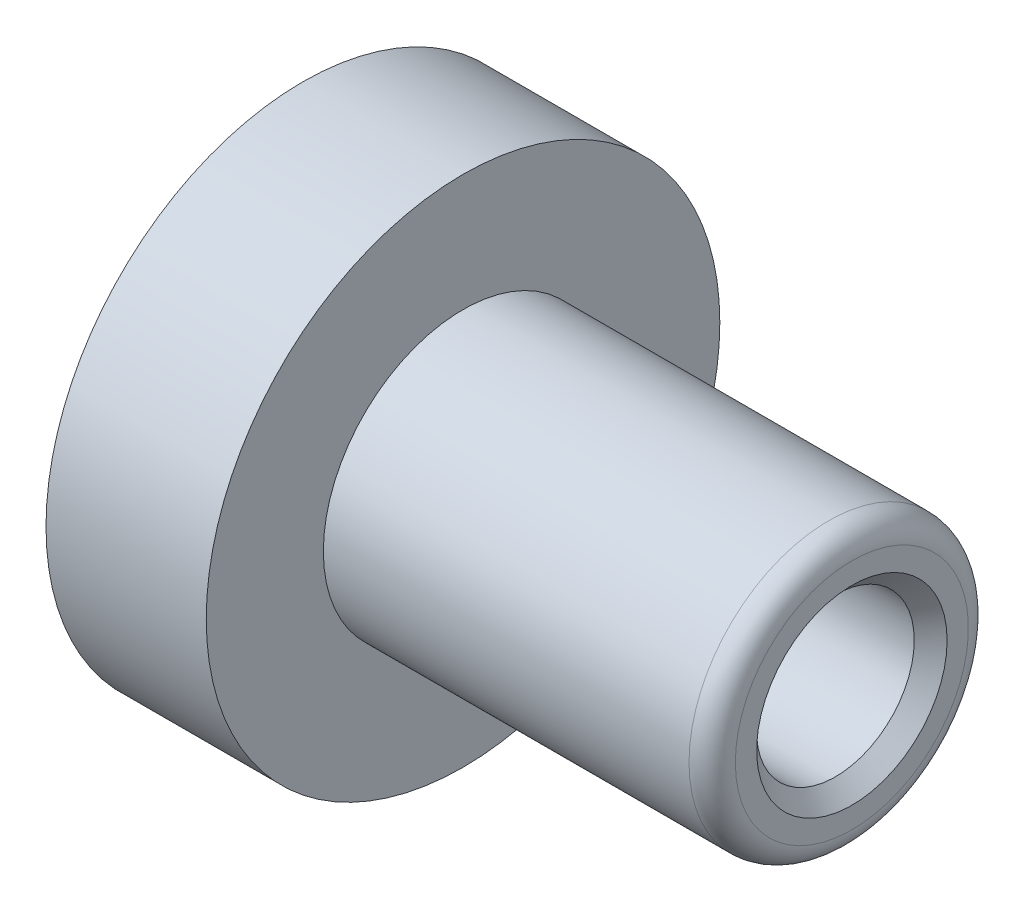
ISO-10303-21;
HEADER;
FILE_DESCRIPTION(('STEP AP214'),'2;1');
FILE_NAME('part.step','',(''),(''),'','','');
FILE_SCHEMA(('AUTOMOTIVE_DESIGN { 1 0 10303 214 1 1 1 1 }'));
ENDSEC;
DATA;
#1=APPLICATION_CONTEXT('core data for automotive mechanical design processes');
#2=APPLICATION_PROTOCOL_DEFINITION('international standard','automotive_design',2000,#1);
#3=PRODUCT_CONTEXT('',#1,'mechanical');
#4=PRODUCT('Part','Part','',(#3));
#5=PRODUCT_RELATED_PRODUCT_CATEGORY('part','',(#4));
#6=PRODUCT_DEFINITION_FORMATION('','',#4);
#7=PRODUCT_DEFINITION_CONTEXT('part definition',#1,'design');
#8=PRODUCT_DEFINITION('design','',#6,#7);
#9=PRODUCT_DEFINITION_SHAPE('','',#8);
#10=(LENGTH_UNIT() NAMED_UNIT(*) SI_UNIT(.MILLI.,.METRE.));
#11=(NAMED_UNIT(*) PLANE_ANGLE_UNIT() SI_UNIT($,.RADIAN.));
#12=(NAMED_UNIT(*) SI_UNIT($,.STERADIAN.) SOLID_ANGLE_UNIT());
#13=UNCERTAINTY_MEASURE_WITH_UNIT(LENGTH_MEASURE(1.E-05),#10,'distance_accuracy_value','');
#14=(GEOMETRIC_REPRESENTATION_CONTEXT(3) GLOBAL_UNCERTAINTY_ASSIGNED_CONTEXT((#13)) GLOBAL_UNIT_ASSIGNED_CONTEXT((#10,
#11,#12)) REPRESENTATION_CONTEXT('',''));
#15=CARTESIAN_POINT('',(0.,0.,0.));
#16=DIRECTION('',(0.,0.,1.));
#17=DIRECTION('',(1.,0.,0.));
#18=AXIS2_PLACEMENT_3D('',#15,#16,#17);
#19=CARTESIAN_POINT('',(0.,0.,0.));
#20=DIRECTION('',(-1.,0.,0.));
#21=DIRECTION('',(0.,0.,1.));
#22=AXIS2_PLACEMENT_3D('',#19,#20,#21);
#23=CYLINDRICAL_SURFACE('',#22,6.7437);
#24=CARTESIAN_POINT('',(20.447,0.,0.));
#25=DIRECTION('',(-1.,0.,0.));
#26=DIRECTION('',(0.,0.,1.));
#27=AXIS2_PLACEMENT_3D('',#24,#25,#26);
#28=CIRCLE('',#27,6.7437);
#29=CARTESIAN_POINT('',(20.447,0.,6.7437));
#30=VERTEX_POINT('',#29);
#31=EDGE_CURVE('E42',#30,#30,#28,.T.);
#32=ORIENTED_EDGE('',*,*,#31,.F.);
#33=EDGE_LOOP('',(#32));
#34=FACE_BOUND('',#33,.T.);
#35=CARTESIAN_POINT('',(0.,0.,0.));
#36=DIRECTION('',(-1.,0.,0.));
#37=DIRECTION('',(0.,0.,1.));
#38=AXIS2_PLACEMENT_3D('',#35,#36,#37);
#39=CIRCLE('',#38,6.7437);
#40=CARTESIAN_POINT('',(0.,0.,6.7437));
#41=VERTEX_POINT('',#40);
#42=EDGE_CURVE('E63',#41,#41,#39,.T.);
#43=ORIENTED_EDGE('',*,*,#42,.T.);
#44=EDGE_LOOP('',(#43));
#45=FACE_BOUND('',#44,.T.);
#46=ADVANCED_FACE('F31',(#34,#45),#23,.F.);
#47=CARTESIAN_POINT('',(20.447,6.7437,0.));
#48=DIRECTION('',(1.,0.,0.));
#49=DIRECTION('',(0.,0.,-1.));
#50=AXIS2_PLACEMENT_3D('',#47,#48,#49);
#51=PLANE('',#50);
#52=CARTESIAN_POINT('',(20.447,0.,0.));
#53=DIRECTION('',(1.,0.,0.));
#54=DIRECTION('',(0.,0.,-1.));
#55=AXIS2_PLACEMENT_3D('',#52,#53,#54);
#56=CIRCLE('',#55,5.3594);
#57=CARTESIAN_POINT('',(20.447,0.,-5.3594));
#58=VERTEX_POINT('',#57);
#59=EDGE_CURVE('E76',#58,#58,#56,.T.);
#60=ORIENTED_EDGE('',*,*,#59,.T.);
#61=EDGE_LOOP('',(#60));
#62=FACE_BOUND('',#61,.T.);
#63=ORIENTED_EDGE('',*,*,#31,.T.);
#64=EDGE_LOOP('',(#63));
#65=FACE_BOUND('',#64,.T.);
#66=ADVANCED_FACE('F82',(#62,#65),#51,.F.);
#67=CARTESIAN_POINT('',(37.338,7.9248,0.));
#68=DIRECTION('',(-1.,0.,0.));
#69=DIRECTION('',(0.,0.,1.));
#70=AXIS2_PLACEMENT_3D('',#67,#68,#69);
#71=PLANE('',#70);
#72=CARTESIAN_POINT('',(37.338,0.,0.));
#73=DIRECTION('',(-1.,0.,0.));
#74=DIRECTION('',(0.,0.,1.));
#75=AXIS2_PLACEMENT_3D('',#72,#73,#74);
#76=CIRCLE('',#75,6.477);
#77=CARTESIAN_POINT('',(37.338,0.,-6.477));
#78=VERTEX_POINT('',#77);
#79=EDGE_CURVE('E10',#78,#78,#76,.T.);
#80=ORIENTED_EDGE('',*,*,#79,.T.);
#81=EDGE_LOOP('',(#80));
#82=FACE_BOUND('',#81,.T.);
#83=CARTESIAN_POINT('',(37.338,0.,0.));
#84=DIRECTION('',(-1.,0.,0.));
#85=DIRECTION('',(0.,0.,1.));
#86=AXIS2_PLACEMENT_3D('',#83,#84,#85);
#87=CIRCLE('',#86,7.9248);
#88=CARTESIAN_POINT('',(37.338,0.,7.9248));
#89=VERTEX_POINT('',#88);
#90=EDGE_CURVE('E46',#89,#89,#87,.T.);
#91=ORIENTED_EDGE('',*,*,#90,.F.);
#92=EDGE_LOOP('',(#91));
#93=FACE_BOUND('',#92,.T.);
#94=ADVANCED_FACE('F102',(#82,#93),#71,.F.);
#95=CARTESIAN_POINT('',(35.7632,0.,0.));
#96=DIRECTION('',(-1.,0.,0.));
#97=DIRECTION('',(0.,0.,1.));
#98=AXIS2_PLACEMENT_3D('',#95,#96,#97);
#99=TOROIDAL_SURFACE('',#98,7.9248,1.5748);
#100=CARTESIAN_POINT('',(35.7632,0.,0.));
#101=DIRECTION('',(-1.,0.,0.));
#102=DIRECTION('',(0.,0.,1.));
#103=AXIS2_PLACEMENT_3D('',#100,#101,#102);
#104=CIRCLE('',#103,9.4996);
#105=CARTESIAN_POINT('',(35.7632,0.,9.4996));
#106=VERTEX_POINT('',#105);
#107=EDGE_CURVE('E51',#106,#106,#104,.T.);
#108=ORIENTED_EDGE('',*,*,#107,.F.);
#109=EDGE_LOOP('',(#108));
#110=FACE_BOUND('',#109,.T.);
#111=ORIENTED_EDGE('',*,*,#90,.T.);
#112=EDGE_LOOP('',(#111));
#113=FACE_BOUND('',#112,.T.);
#114=ADVANCED_FACE('F109',(#110,#113),#99,.T.);
#115=CARTESIAN_POINT('',(0.,0.,0.));
#116=DIRECTION('',(-1.,0.,0.));
#117=DIRECTION('',(0.,0.,1.));
#118=AXIS2_PLACEMENT_3D('',#115,#116,#117);
#119=CYLINDRICAL_SURFACE('',#118,9.4996);
#120=CARTESIAN_POINT('',(10.8966,0.,0.));
#121=DIRECTION('',(-1.,0.,0.));
#122=DIRECTION('',(0.,0.,1.));
#123=AXIS2_PLACEMENT_3D('',#120,#121,#122);
#124=CIRCLE('',#123,9.4996);
#125=CARTESIAN_POINT('',(10.8966,0.,9.4996));
#126=VERTEX_POINT('',#125);
#127=EDGE_CURVE('E54',#126,#126,#124,.T.);
#128=ORIENTED_EDGE('',*,*,#127,.F.);
#129=EDGE_LOOP('',(#128));
#130=FACE_BOUND('',#129,.T.);
#131=ORIENTED_EDGE('',*,*,#107,.T.);
#132=EDGE_LOOP('',(#131));
#133=FACE_BOUND('',#132,.T.);
#134=ADVANCED_FACE('F112',(#130,#133),#119,.T.);
#135=CARTESIAN_POINT('',(10.8966,17.4625,0.));
#136=DIRECTION('',(-1.,0.,0.));
#137=DIRECTION('',(0.,0.,1.));
#138=AXIS2_PLACEMENT_3D('',#135,#136,#137);
#139=PLANE('',#138);
#140=CARTESIAN_POINT('',(10.8966,0.,0.));
#141=DIRECTION('',(-1.,0.,0.));
#142=DIRECTION('',(0.,0.,1.));
#143=AXIS2_PLACEMENT_3D('',#140,#141,#142);
#144=CIRCLE('',#143,17.4625);
#145=CARTESIAN_POINT('',(10.8966,0.,17.4625));
#146=VERTEX_POINT('',#145);
#147=EDGE_CURVE('E57',#146,#146,#144,.T.);
#148=ORIENTED_EDGE('',*,*,#147,.F.);
#149=EDGE_LOOP('',(#148));
#150=FACE_BOUND('',#149,.T.);
#151=ORIENTED_EDGE('',*,*,#127,.T.);
#152=EDGE_LOOP('',(#151));
#153=FACE_BOUND('',#152,.T.);
#154=ADVANCED_FACE('F116',(#150,#153),#139,.F.);
#155=CARTESIAN_POINT('',(0.,0.,0.));
#156=DIRECTION('',(-1.,0.,0.));
#157=DIRECTION('',(0.,0.,1.));
#158=AXIS2_PLACEMENT_3D('',#155,#156,#157);
#159=CYLINDRICAL_SURFACE('',#158,17.4625);
#160=CARTESIAN_POINT('',(0.,0.,0.));
#161=DIRECTION('',(-1.,0.,0.));
#162=DIRECTION('',(0.,0.,1.));
#163=AXIS2_PLACEMENT_3D('',#160,#161,#162);
#164=CIRCLE('',#163,17.4625);
#165=CARTESIAN_POINT('',(0.,0.,17.4625));
#166=VERTEX_POINT('',#165);
#167=EDGE_CURVE('E60',#166,#166,#164,.T.);
#168=ORIENTED_EDGE('',*,*,#167,.F.);
#169=EDGE_LOOP('',(#168));
#170=FACE_BOUND('',#169,.T.);
#171=ORIENTED_EDGE('',*,*,#147,.T.);
#172=EDGE_LOOP('',(#171));
#173=FACE_BOUND('',#172,.T.);
#174=ADVANCED_FACE('F120',(#170,#173),#159,.T.);
#175=CARTESIAN_POINT('',(0.,6.7437,0.));
#176=DIRECTION('',(1.,0.,0.));
#177=DIRECTION('',(0.,0.,-1.));
#178=AXIS2_PLACEMENT_3D('',#175,#176,#177);
#179=PLANE('',#178);
#180=CARTESIAN_POINT('',(0.,0.,11.1125));
#181=DIRECTION('',(-1.,0.,0.));
#182=DIRECTION('',(0.,0.,-1.));
#183=AXIS2_PLACEMENT_3D('',#180,#181,#182);
#184=CIRCLE('',#183,1.6129);
#185=CARTESIAN_POINT('',(0.,0.,9.4996));
#186=VERTEX_POINT('',#185);
#187=EDGE_CURVE('E73',#186,#186,#184,.T.);
#188=ORIENTED_EDGE('',*,*,#187,.F.);
#189=EDGE_LOOP('',(#188));
#190=FACE_BOUND('',#189,.T.);
#191=CARTESIAN_POINT('',(0.,0.,-11.1125));
#192=DIRECTION('',(-1.,0.,0.));
#193=DIRECTION('',(0.,0.,1.));
#194=AXIS2_PLACEMENT_3D('',#191,#192,#193);
#195=CIRCLE('',#194,1.6129);
#196=CARTESIAN_POINT('',(0.,0.,-9.4996));
#197=VERTEX_POINT('',#196);
#198=EDGE_CURVE('E67',#197,#197,#195,.T.);
#199=ORIENTED_EDGE('',*,*,#198,.F.);
#200=EDGE_LOOP('',(#199));
#201=FACE_BOUND('',#200,.T.);
#202=ORIENTED_EDGE('',*,*,#42,.F.);
#203=EDGE_LOOP('',(#202));
#204=FACE_BOUND('',#203,.T.);
#205=ORIENTED_EDGE('',*,*,#167,.T.);
#206=EDGE_LOOP('',(#205));
#207=FACE_BOUND('',#206,.T.);
#208=ADVANCED_FACE('F124',(#190,#201,#204,#207),#179,.F.);
#209=CARTESIAN_POINT('',(6.35,0.,-11.1125));
#210=DIRECTION('',(-1.,0.,0.));
#211=DIRECTION('',(0.,0.,1.));
#212=AXIS2_PLACEMENT_3D('',#209,#210,#211);
#213=CYLINDRICAL_SURFACE('',#212,1.6129);
#214=CARTESIAN_POINT('',(6.35,0.,-11.1125));
#215=DIRECTION('',(-1.,0.,0.));
#216=DIRECTION('',(0.,0.,1.));
#217=AXIS2_PLACEMENT_3D('',#214,#215,#216);
#218=CIRCLE('',#217,1.6129);
#219=CARTESIAN_POINT('',(6.35,0.,-9.4996));
#220=VERTEX_POINT('',#219);
#221=EDGE_CURVE('E66',#220,#220,#218,.T.);
#222=ORIENTED_EDGE('',*,*,#221,.F.);
#223=EDGE_LOOP('',(#222));
#224=FACE_BOUND('',#223,.T.);
#225=ORIENTED_EDGE('',*,*,#198,.T.);
#226=EDGE_LOOP('',(#225));
#227=FACE_BOUND('',#226,.T.);
#228=ADVANCED_FACE('F128',(#224,#227),#213,.F.);
#229=CARTESIAN_POINT('',(6.35,0.,-11.1125));
#230=DIRECTION('',(-1.,0.,0.));
#231=DIRECTION('',(0.,0.,1.));
#232=AXIS2_PLACEMENT_3D('',#229,#230,#231);
#233=PLANE('',#232);
#234=ORIENTED_EDGE('',*,*,#221,.T.);
#235=EDGE_LOOP('',(#234));
#236=FACE_BOUND('',#235,.T.);
#237=ADVANCED_FACE('F132',(#236),#233,.T.);
#238=CARTESIAN_POINT('',(6.35,0.,11.1125));
#239=DIRECTION('',(-1.,0.,0.));
#240=DIRECTION('',(0.,0.,1.));
#241=AXIS2_PLACEMENT_3D('',#238,#239,#240);
#242=CYLINDRICAL_SURFACE('',#241,1.6129);
#243=CARTESIAN_POINT('',(6.35,0.,11.1125));
#244=DIRECTION('',(-1.,0.,0.));
#245=DIRECTION('',(0.,0.,-1.));
#246=AXIS2_PLACEMENT_3D('',#243,#244,#245);
#247=CIRCLE('',#246,1.6129);
#248=CARTESIAN_POINT('',(6.35,0.,9.4996));
#249=VERTEX_POINT('',#248);
#250=EDGE_CURVE('E70',#249,#249,#247,.T.);
#251=ORIENTED_EDGE('',*,*,#250,.F.);
#252=EDGE_LOOP('',(#251));
#253=FACE_BOUND('',#252,.T.);
#254=ORIENTED_EDGE('',*,*,#187,.T.);
#255=EDGE_LOOP('',(#254));
#256=FACE_BOUND('',#255,.T.);
#257=ADVANCED_FACE('F94',(#253,#256),#242,.F.);
#258=CARTESIAN_POINT('',(6.35,0.,11.1125));
#259=DIRECTION('',(1.,0.,0.));
#260=DIRECTION('',(0.,0.,-1.));
#261=AXIS2_PLACEMENT_3D('',#258,#259,#260);
#262=PLANE('',#261);
#263=ORIENTED_EDGE('',*,*,#250,.T.);
#264=EDGE_LOOP('',(#263));
#265=FACE_BOUND('',#264,.T.);
#266=ADVANCED_FACE('F87',(#265),#262,.F.);
#267=CARTESIAN_POINT('',(0.,0.,0.));
#268=DIRECTION('',(1.,0.,0.));
#269=DIRECTION('',(0.,0.,-1.));
#270=AXIS2_PLACEMENT_3D('',#267,#268,#269);
#271=CYLINDRICAL_SURFACE('',#270,5.3594);
#272=CARTESIAN_POINT('',(36.2204,0.,0.));
#273=DIRECTION('',(-1.,0.,0.));
#274=DIRECTION('',(0.,0.,1.));
#275=AXIS2_PLACEMENT_3D('',#272,#273,#274);
#276=CIRCLE('',#275,5.3594);
#277=CARTESIAN_POINT('',(36.2204,0.,-5.3594));
#278=VERTEX_POINT('',#277);
#279=EDGE_CURVE('E38',#278,#278,#276,.F.);
#280=ORIENTED_EDGE('',*,*,#279,.T.);
#281=EDGE_LOOP('',(#280));
#282=FACE_BOUND('',#281,.T.);
#283=ORIENTED_EDGE('',*,*,#59,.F.);
#284=EDGE_LOOP('',(#283));
#285=FACE_BOUND('',#284,.T.);
#286=ADVANCED_FACE('F85',(#282,#285),#271,.F.);
#287=CARTESIAN_POINT('',(36.2204,0.,0.));
#288=DIRECTION('',(1.,0.,0.));
#289=DIRECTION('',(0.,0.,-1.));
#290=AXIS2_PLACEMENT_3D('',#287,#288,#289);
#291=CONICAL_SURFACE('',#290,5.3594,0.785398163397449);
#292=CARTESIAN_POINT('',(37.338,0.,-6.477));
#293=CARTESIAN_POINT('',(37.3263583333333,0.,-6.46535833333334));
#294=CARTESIAN_POINT('',(37.3147166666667,0.,-6.45371666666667));
#295=CARTESIAN_POINT('',(37.2914333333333,0.,-6.43043333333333));
#296=CARTESIAN_POINT('',(37.2797916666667,0.,-6.41879166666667));
#297=CARTESIAN_POINT('',(37.2565083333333,0.,-6.39550833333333));
#298=CARTESIAN_POINT('',(37.2448666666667,0.,-6.38386666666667));
#299=CARTESIAN_POINT('',(37.2215833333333,0.,-6.36058333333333));
#300=CARTESIAN_POINT('',(37.2099416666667,0.,-6.34894166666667));
#301=CARTESIAN_POINT('',(37.1866583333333,0.,-6.32565833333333));
#302=CARTESIAN_POINT('',(37.1750166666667,0.,-6.31401666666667));
#303=CARTESIAN_POINT('',(37.1517333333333,0.,-6.29073333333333));
#304=CARTESIAN_POINT('',(37.1400916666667,0.,-6.27909166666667));
#305=CARTESIAN_POINT('',(37.1168083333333,0.,-6.25580833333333));
#306=CARTESIAN_POINT('',(37.1051666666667,0.,-6.24416666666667));
#307=CARTESIAN_POINT('',(37.0818833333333,0.,-6.22088333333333));
#308=CARTESIAN_POINT('',(37.0702416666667,0.,-6.20924166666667));
#309=CARTESIAN_POINT('',(37.0469583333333,0.,-6.18595833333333));
#310=CARTESIAN_POINT('',(37.0353166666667,0.,-6.17431666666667));
#311=CARTESIAN_POINT('',(37.0120333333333,0.,-6.15103333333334));
#312=CARTESIAN_POINT('',(37.0003916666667,0.,-6.13939166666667));
#313=CARTESIAN_POINT('',(36.9771083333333,0.,-6.11610833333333));
#314=CARTESIAN_POINT('',(36.9654666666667,0.,-6.10446666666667));
#315=CARTESIAN_POINT('',(36.9421833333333,0.,-6.08118333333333));
#316=CARTESIAN_POINT('',(36.9305416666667,0.,-6.06954166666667));
#317=CARTESIAN_POINT('',(36.9072583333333,0.,-6.04625833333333));
#318=CARTESIAN_POINT('',(36.8956166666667,0.,-6.03461666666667));
#319=CARTESIAN_POINT('',(36.8723333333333,0.,-6.01133333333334));
#320=CARTESIAN_POINT('',(36.8606916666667,0.,-5.99969166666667));
#321=CARTESIAN_POINT('',(36.8374083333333,0.,-5.97640833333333));
#322=CARTESIAN_POINT('',(36.8257666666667,0.,-5.96476666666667));
#323=CARTESIAN_POINT('',(36.8024833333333,0.,-5.94148333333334));
#324=CARTESIAN_POINT('',(36.7908416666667,0.,-5.92984166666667));
#325=CARTESIAN_POINT('',(36.7675583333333,0.,-5.90655833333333));
#326=CARTESIAN_POINT('',(36.7559166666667,0.,-5.89491666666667));
#327=CARTESIAN_POINT('',(36.7326333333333,0.,-5.87163333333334));
#328=CARTESIAN_POINT('',(36.7209916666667,0.,-5.85999166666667));
#329=CARTESIAN_POINT('',(36.6977083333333,0.,-5.83670833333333));
#330=CARTESIAN_POINT('',(36.6860666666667,0.,-5.82506666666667));
#331=CARTESIAN_POINT('',(36.6627833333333,0.,-5.80178333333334));
#332=CARTESIAN_POINT('',(36.6511416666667,0.,-5.79014166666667));
#333=CARTESIAN_POINT('',(36.6278583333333,0.,-5.76685833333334));
#334=CARTESIAN_POINT('',(36.6162166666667,0.,-5.75521666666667));
#335=CARTESIAN_POINT('',(36.5929333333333,0.,-5.73193333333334));
#336=CARTESIAN_POINT('',(36.5812916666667,0.,-5.72029166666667));
#337=CARTESIAN_POINT('',(36.5580083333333,0.,-5.69700833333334));
#338=CARTESIAN_POINT('',(36.5463666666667,0.,-5.68536666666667));
#339=CARTESIAN_POINT('',(36.5230833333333,0.,-5.66208333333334));
#340=CARTESIAN_POINT('',(36.5114416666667,0.,-5.65044166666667));
#341=CARTESIAN_POINT('',(36.4881583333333,0.,-5.62715833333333));
#342=CARTESIAN_POINT('',(36.4765166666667,0.,-5.61551666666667));
#343=CARTESIAN_POINT('',(36.4532333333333,0.,-5.59223333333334));
#344=CARTESIAN_POINT('',(36.4415916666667,0.,-5.58059166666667));
#345=CARTESIAN_POINT('',(36.4183083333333,0.,-5.55730833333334));
#346=CARTESIAN_POINT('',(36.4066666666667,0.,-5.54566666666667));
#347=CARTESIAN_POINT('',(36.3833833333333,0.,-5.52238333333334));
#348=CARTESIAN_POINT('',(36.3717416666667,0.,-5.51074166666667));
#349=CARTESIAN_POINT('',(36.3484583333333,0.,-5.48745833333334));
#350=CARTESIAN_POINT('',(36.3368166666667,0.,-5.47581666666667));
#351=CARTESIAN_POINT('',(36.3135333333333,0.,-5.45253333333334));
#352=CARTESIAN_POINT('',(36.3018916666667,0.,-5.44089166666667));
#353=CARTESIAN_POINT('',(36.2786083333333,0.,-5.41760833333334));
#354=CARTESIAN_POINT('',(36.2669666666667,0.,-5.40596666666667));
#355=CARTESIAN_POINT('',(36.2436833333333,0.,-5.38268333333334));
#356=CARTESIAN_POINT('',(36.2320416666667,0.,-5.37104166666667));
#357=CARTESIAN_POINT('',(36.2204,0.,-5.3594));
#358=B_SPLINE_CURVE_WITH_KNOTS('',3,(#292,#293,#294,#295,#296,#297,#298,#299,#300,#301,#302,
#303,#304,#305,#306,#307,#308,#309,#310,#311,#312,#313,#314,#315,#316,#317,#318,#319,#320,#321,
#322,#323,#324,#325,#326,#327,#328,#329,#330,#331,#332,#333,#334,#335,#336,#337,#338,#339,#340,
#341,#342,#343,#344,#345,#346,#347,#348,#349,#350,#351,#352,#353,#354,#355,#356,#357),
.UNSPECIFIED.,.F.,.F.,(4,2,2,2,2,2,2,2,2,2,2,2,2,2,2,2,2,2,2,2,2,2,2,2,2,2,2,2,2,2,2,2,4),(0.,
0.0493914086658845,0.0987828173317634,0.148174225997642,0.197565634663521,0.246957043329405,
0.296348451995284,0.345739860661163,0.395131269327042,0.444522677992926,0.493914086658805,
0.543305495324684,0.592696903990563,0.642088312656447,0.691479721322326,0.740871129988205,
0.790262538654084,0.839653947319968,0.889045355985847,0.938436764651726,0.987828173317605,
1.03721958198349,1.08661099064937,1.13600239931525,1.18539380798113,1.23478521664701,
1.28417662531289,1.33356803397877,1.38295944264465,1.43235085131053,1.48174225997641,
1.53113366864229,1.58052507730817),.UNSPECIFIED.);
#359=EDGE_CURVE('BSEAM33',#78,#278,#358,.T.);
#360=ORIENTED_EDGE('',*,*,#79,.F.);
#361=ORIENTED_EDGE('',*,*,#279,.F.);
#362=ORIENTED_EDGE('',*,*,#359,.T.);
#363=ORIENTED_EDGE('',*,*,#359,.F.);
#364=EDGE_LOOP('',(#360,#362,#361,#363));
#365=FACE_BOUND('',#364,.T.);
#366=ADVANCED_FACE('F33',(#365),#291,.F.);
#367=CLOSED_SHELL('',(#46,#66,#94,#114,#134,#154,#174,#208,#228,#237,#257,#266,#286,#366));
#368=MANIFOLD_SOLID_BREP('B2',#367);
#369=ADVANCED_BREP_SHAPE_REPRESENTATION('',(#18,#368),#14);
#370=SHAPE_DEFINITION_REPRESENTATION(#9,#369);
ENDSEC;
END-ISO-10303-21;
